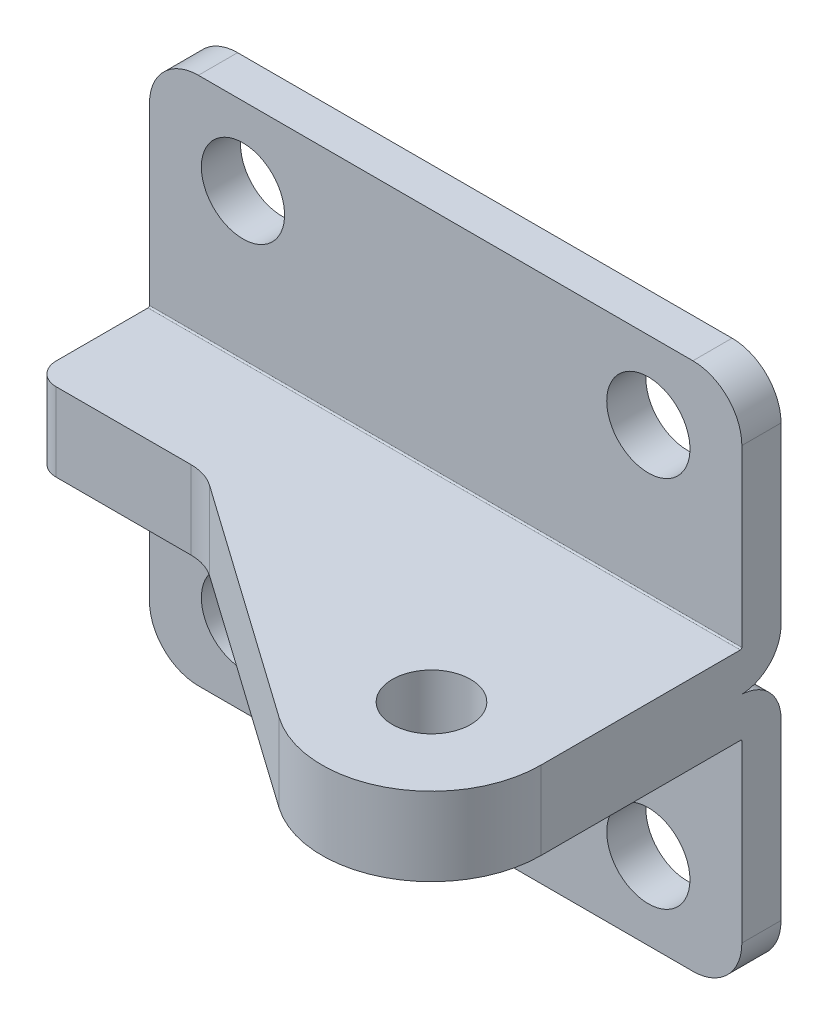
ISO-10303-21;
HEADER;
FILE_DESCRIPTION(('STEP AP214'),'2;1');
FILE_NAME('part.step','',(''),(''),'','','');
FILE_SCHEMA(('AUTOMOTIVE_DESIGN { 1 0 10303 214 1 1 1 1 }'));
ENDSEC;
DATA;
#1=APPLICATION_CONTEXT('core data for automotive mechanical design processes');
#2=APPLICATION_PROTOCOL_DEFINITION('international standard','automotive_design',2000,#1);
#3=PRODUCT_CONTEXT('',#1,'mechanical');
#4=PRODUCT('Part','Part','',(#3));
#5=PRODUCT_RELATED_PRODUCT_CATEGORY('part','',(#4));
#6=PRODUCT_DEFINITION_FORMATION('','',#4);
#7=PRODUCT_DEFINITION_CONTEXT('part definition',#1,'design');
#8=PRODUCT_DEFINITION('design','',#6,#7);
#9=PRODUCT_DEFINITION_SHAPE('','',#8);
#10=(LENGTH_UNIT() NAMED_UNIT(*) SI_UNIT(.MILLI.,.METRE.));
#11=(NAMED_UNIT(*) PLANE_ANGLE_UNIT() SI_UNIT($,.RADIAN.));
#12=(NAMED_UNIT(*) SI_UNIT($,.STERADIAN.) SOLID_ANGLE_UNIT());
#13=UNCERTAINTY_MEASURE_WITH_UNIT(LENGTH_MEASURE(1.E-05),#10,'distance_accuracy_value','');
#14=(GEOMETRIC_REPRESENTATION_CONTEXT(3) GLOBAL_UNCERTAINTY_ASSIGNED_CONTEXT((#13)) GLOBAL_UNIT_ASSIGNED_CONTEXT((#10,
#11,#12)) REPRESENTATION_CONTEXT('',''));
#15=CARTESIAN_POINT('',(0.,0.,0.));
#16=DIRECTION('',(0.,0.,1.));
#17=DIRECTION('',(1.,0.,0.));
#18=AXIS2_PLACEMENT_3D('',#15,#16,#17);
#19=CARTESIAN_POINT('',(-4.55,46.0499958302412,4.));
#20=DIRECTION('',(0.,-1.,0.));
#21=DIRECTION('',(1.,0.,0.));
#22=AXIS2_PLACEMENT_3D('',#19,#20,#21);
#23=PLANE('',#22);
#24=DIRECTION('',(0.,0.,-1.));
#25=VECTOR('',#24,1.);
#26=CARTESIAN_POINT('',(-4.55,46.0499958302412,4.));
#27=LINE('',#26,#25);
#28=CARTESIAN_POINT('',(-4.55,46.0499958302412,4.));
#29=VERTEX_POINT('',#28);
#30=CARTESIAN_POINT('',(-4.55,46.0499958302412,0.));
#31=VERTEX_POINT('',#30);
#32=EDGE_CURVE('E306',#29,#31,#27,.T.);
#33=ORIENTED_EDGE('',*,*,#32,.F.);
#34=DIRECTION('',(1.,0.,0.));
#35=VECTOR('',#34,1.);
#36=CARTESIAN_POINT('',(-4.55,46.0499958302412,4.));
#37=LINE('',#36,#35);
#38=CARTESIAN_POINT('',(45.95,46.0499958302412,4.));
#39=VERTEX_POINT('',#38);
#40=EDGE_CURVE('E307',#39,#29,#37,.F.);
#41=ORIENTED_EDGE('',*,*,#40,.F.);
#42=DIRECTION('',(0.,0.,1.));
#43=VECTOR('',#42,1.);
#44=CARTESIAN_POINT('',(45.95,46.0499958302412,4.));
#45=LINE('',#44,#43);
#46=CARTESIAN_POINT('',(45.95,46.0499958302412,0.));
#47=VERTEX_POINT('',#46);
#48=EDGE_CURVE('E303',#47,#39,#45,.T.);
#49=ORIENTED_EDGE('',*,*,#48,.F.);
#50=DIRECTION('',(-1.,0.,0.));
#51=VECTOR('',#50,1.);
#52=CARTESIAN_POINT('',(45.95,46.0499958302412,0.));
#53=LINE('',#52,#51);
#54=EDGE_CURVE('E323',#47,#31,#53,.T.);
#55=ORIENTED_EDGE('',*,*,#54,.T.);
#56=EDGE_LOOP('',(#33,#41,#49,#55));
#57=FACE_BOUND('',#56,.T.);
#58=ADVANCED_FACE('F14',(#57),#23,.F.);
#59=CARTESIAN_POINT('',(0.,38.0999958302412,4.));
#60=DIRECTION('',(0.,0.,1.));
#61=DIRECTION('',(-1.,0.,0.));
#62=AXIS2_PLACEMENT_3D('',#59,#60,#61);
#63=CYLINDRICAL_SURFACE('',#62,4.25);
#64=CARTESIAN_POINT('',(0.,38.0999958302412,0.));
#65=DIRECTION('',(0.,0.,1.));
#66=DIRECTION('',(-1.,0.,0.));
#67=AXIS2_PLACEMENT_3D('',#64,#65,#66);
#68=CIRCLE('',#67,4.25);
#69=CARTESIAN_POINT('',(-4.25,38.0999958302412,0.));
#70=VERTEX_POINT('',#69);
#71=EDGE_CURVE('E316',#70,#70,#68,.F.);
#72=ORIENTED_EDGE('',*,*,#71,.T.);
#73=EDGE_LOOP('',(#72));
#74=FACE_BOUND('',#73,.T.);
#75=CARTESIAN_POINT('',(0.,38.0999958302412,4.));
#76=DIRECTION('',(0.,0.,1.));
#77=DIRECTION('',(-1.,0.,0.));
#78=AXIS2_PLACEMENT_3D('',#75,#76,#77);
#79=CIRCLE('',#78,4.25);
#80=CARTESIAN_POINT('',(-4.25,38.0999958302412,4.));
#81=VERTEX_POINT('',#80);
#82=EDGE_CURVE('E298',#81,#81,#79,.F.);
#83=ORIENTED_EDGE('',*,*,#82,.F.);
#84=EDGE_LOOP('',(#83));
#85=FACE_BOUND('',#84,.T.);
#86=ADVANCED_FACE('F413',(#74,#85),#63,.F.);
#87=CARTESIAN_POINT('',(41.4,38.0999958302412,4.));
#88=DIRECTION('',(0.,0.,1.));
#89=DIRECTION('',(-1.,0.,0.));
#90=AXIS2_PLACEMENT_3D('',#87,#88,#89);
#91=CYLINDRICAL_SURFACE('',#90,4.25);
#92=CARTESIAN_POINT('',(41.4,38.0999958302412,0.));
#93=DIRECTION('',(0.,0.,1.));
#94=DIRECTION('',(-1.,0.,0.));
#95=AXIS2_PLACEMENT_3D('',#92,#93,#94);
#96=CIRCLE('',#95,4.25);
#97=CARTESIAN_POINT('',(37.15,38.0999958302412,0.));
#98=VERTEX_POINT('',#97);
#99=EDGE_CURVE('E313',#98,#98,#96,.F.);
#100=ORIENTED_EDGE('',*,*,#99,.T.);
#101=EDGE_LOOP('',(#100));
#102=FACE_BOUND('',#101,.T.);
#103=CARTESIAN_POINT('',(41.4,38.0999958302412,4.));
#104=DIRECTION('',(0.,0.,1.));
#105=DIRECTION('',(-1.,0.,0.));
#106=AXIS2_PLACEMENT_3D('',#103,#104,#105);
#107=CIRCLE('',#106,4.25);
#108=CARTESIAN_POINT('',(37.15,38.0999958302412,4.));
#109=VERTEX_POINT('',#108);
#110=EDGE_CURVE('E295',#109,#109,#107,.F.);
#111=ORIENTED_EDGE('',*,*,#110,.F.);
#112=EDGE_LOOP('',(#111));
#113=FACE_BOUND('',#112,.T.);
#114=ADVANCED_FACE('F419',(#102,#113),#91,.F.);
#115=CARTESIAN_POINT('',(-7.264,23.0499979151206,15.8097999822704));
#116=DIRECTION('',(0.,0.,-1.));
#117=DIRECTION('',(1.,0.,0.));
#118=AXIS2_PLACEMENT_3D('',#115,#116,#117);
#119=PLANE('',#118);
#120=DIRECTION('',(0.,-1.,0.));
#121=VECTOR('',#120,1.);
#122=CARTESIAN_POINT('',(6.49999999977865,23.0499979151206,15.8097999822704));
#123=LINE('',#122,#121);
#124=CARTESIAN_POINT('',(6.49999999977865,15.0499979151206,15.8097999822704));
#125=VERTEX_POINT('',#124);
#126=CARTESIAN_POINT('',(6.49999999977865,23.0499979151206,15.8097999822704));
#127=VERTEX_POINT('',#126);
#128=EDGE_CURVE('E278',#125,#127,#123,.F.);
#129=ORIENTED_EDGE('',*,*,#128,.T.);
#130=DIRECTION('',(1.,0.,0.));
#131=VECTOR('',#130,1.);
#132=CARTESIAN_POINT('',(-7.264,23.0499979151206,15.8097999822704));
#133=LINE('',#132,#131);
#134=CARTESIAN_POINT('',(-7.264,23.0499979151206,15.8097999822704));
#135=VERTEX_POINT('',#134);
#136=EDGE_CURVE('E272',#135,#127,#133,.T.);
#137=ORIENTED_EDGE('',*,*,#136,.F.);
#138=DIRECTION('',(0.,-1.,0.));
#139=VECTOR('',#138,1.);
#140=CARTESIAN_POINT('',(-7.264,23.0499979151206,15.8097999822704));
#141=LINE('',#140,#139);
#142=CARTESIAN_POINT('',(-7.264,15.0499979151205,15.8097999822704));
#143=VERTEX_POINT('',#142);
#144=EDGE_CURVE('E268',#143,#135,#141,.F.);
#145=ORIENTED_EDGE('',*,*,#144,.F.);
#146=DIRECTION('',(-1.,0.,0.));
#147=VECTOR('',#146,1.);
#148=CARTESIAN_POINT('',(45.95,15.0499979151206,15.8097999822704));
#149=LINE('',#148,#147);
#150=EDGE_CURVE('E213',#143,#125,#149,.F.);
#151=ORIENTED_EDGE('',*,*,#150,.T.);
#152=EDGE_LOOP('',(#129,#137,#145,#151));
#153=FACE_BOUND('',#152,.T.);
#154=ADVANCED_FACE('F428',(#153),#119,.F.);
#155=CARTESIAN_POINT('',(6.49999999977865,23.0499979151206,20.6357999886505));
#156=DIRECTION('',(0.,-1.,0.));
#157=DIRECTION('',(1.,0.,0.));
#158=AXIS2_PLACEMENT_3D('',#155,#156,#157);
#159=CYLINDRICAL_SURFACE('',#158,4.8260000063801);
#160=DIRECTION('',(0.,-1.,0.));
#161=VECTOR('',#160,1.);
#162=CARTESIAN_POINT('',(9.28151123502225,23.0499979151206,16.6920110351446));
#163=LINE('',#162,#161);
#164=CARTESIAN_POINT('',(9.28151123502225,15.0499979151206,16.6920110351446));
#165=VERTEX_POINT('',#164);
#166=CARTESIAN_POINT('',(9.28151123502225,23.0499979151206,16.6920110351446));
#167=VERTEX_POINT('',#166);
#168=EDGE_CURVE('E277',#165,#167,#163,.F.);
#169=ORIENTED_EDGE('',*,*,#168,.T.);
#170=CARTESIAN_POINT('',(6.49999999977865,23.0499979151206,20.6357999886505));
#171=DIRECTION('',(0.,-1.,0.));
#172=DIRECTION('',(1.,0.,0.));
#173=AXIS2_PLACEMENT_3D('',#170,#171,#172);
#174=CIRCLE('',#173,4.8260000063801);
#175=EDGE_CURVE('E275',#127,#167,#174,.T.);
#176=ORIENTED_EDGE('',*,*,#175,.F.);
#177=ORIENTED_EDGE('',*,*,#128,.F.);
#178=CARTESIAN_POINT('',(6.49999999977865,15.0499979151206,20.6357999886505));
#179=DIRECTION('',(0.,-1.,0.));
#180=DIRECTION('',(1.,0.,0.));
#181=AXIS2_PLACEMENT_3D('',#178,#179,#180);
#182=CIRCLE('',#181,4.8260000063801);
#183=EDGE_CURVE('E212',#125,#165,#182,.T.);
#184=ORIENTED_EDGE('',*,*,#183,.T.);
#185=EDGE_LOOP('',(#169,#176,#177,#184));
#186=FACE_BOUND('',#185,.T.);
#187=ADVANCED_FACE('F445',(#186),#159,.F.);
#188=CARTESIAN_POINT('',(9.28151123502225,23.0499979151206,16.6920110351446));
#189=DIRECTION('',(0.576359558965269,0.,-0.817196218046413));
#190=DIRECTION('',(0.817196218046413,0.,0.576359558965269));
#191=AXIS2_PLACEMENT_3D('',#188,#189,#190);
#192=PLANE('',#191);
#193=DIRECTION('',(0.,-1.,0.));
#194=VECTOR('',#193,1.);
#195=CARTESIAN_POINT('',(33.3326055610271,23.0499979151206,33.6549849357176));
#196=LINE('',#195,#194);
#197=CARTESIAN_POINT('',(33.3326055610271,23.0499979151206,33.6549849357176));
#198=VERTEX_POINT('',#197);
#199=CARTESIAN_POINT('',(33.3326055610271,15.0499979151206,33.6549849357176));
#200=VERTEX_POINT('',#199);
#201=EDGE_CURVE('E281',#198,#200,#196,.T.);
#202=ORIENTED_EDGE('',*,*,#201,.F.);
#203=DIRECTION('',(0.817196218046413,0.,0.576359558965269));
#204=VECTOR('',#203,1.);
#205=CARTESIAN_POINT('',(9.28151123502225,23.0499979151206,16.6920110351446));
#206=LINE('',#205,#204);
#207=EDGE_CURVE('E282',#167,#198,#206,.T.);
#208=ORIENTED_EDGE('',*,*,#207,.F.);
#209=ORIENTED_EDGE('',*,*,#168,.F.);
#210=DIRECTION('',(0.817196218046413,0.,0.576359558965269));
#211=VECTOR('',#210,1.);
#212=CARTESIAN_POINT('',(9.28151123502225,15.0499979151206,16.6920110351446));
#213=LINE('',#212,#211);
#214=EDGE_CURVE('E209',#165,#200,#213,.T.);
#215=ORIENTED_EDGE('',*,*,#214,.T.);
#216=EDGE_LOOP('',(#202,#208,#209,#215));
#217=FACE_BOUND('',#216,.T.);
#218=ADVANCED_FACE('F442',(#217),#192,.F.);
#219=CARTESIAN_POINT('',(-4.55,41.0499958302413,4.));
#220=DIRECTION('',(0.,0.,-1.));
#221=DIRECTION('',(1.,0.,0.));
#222=AXIS2_PLACEMENT_3D('',#219,#220,#221);
#223=CYLINDRICAL_SURFACE('',#222,5.);
#224=CARTESIAN_POINT('',(-4.55,41.0499958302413,4.));
#225=DIRECTION('',(0.,0.,-1.));
#226=DIRECTION('',(1.,0.,0.));
#227=AXIS2_PLACEMENT_3D('',#224,#225,#226);
#228=CIRCLE('',#227,5.);
#229=CARTESIAN_POINT('',(-9.55,41.0499958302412,4.));
#230=VERTEX_POINT('',#229);
#231=EDGE_CURVE('E304',#230,#29,#228,.T.);
#232=ORIENTED_EDGE('',*,*,#231,.T.);
#233=ORIENTED_EDGE('',*,*,#32,.T.);
#234=CARTESIAN_POINT('',(-4.55,41.0499958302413,0.));
#235=DIRECTION('',(0.,0.,-1.));
#236=DIRECTION('',(1.,0.,0.));
#237=AXIS2_PLACEMENT_3D('',#234,#235,#236);
#238=CIRCLE('',#237,5.);
#239=CARTESIAN_POINT('',(-9.55,41.0499958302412,0.));
#240=VERTEX_POINT('',#239);
#241=EDGE_CURVE('E324',#31,#240,#238,.F.);
#242=ORIENTED_EDGE('',*,*,#241,.T.);
#243=DIRECTION('',(0.,0.,1.));
#244=VECTOR('',#243,1.);
#245=CARTESIAN_POINT('',(-9.55,41.0499958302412,4.));
#246=LINE('',#245,#244);
#247=EDGE_CURVE('E352',#240,#230,#246,.T.);
#248=ORIENTED_EDGE('',*,*,#247,.T.);
#249=EDGE_LOOP('',(#232,#233,#242,#248));
#250=FACE_BOUND('',#249,.T.);
#251=ADVANCED_FACE('F382',(#250),#223,.T.);
#252=CARTESIAN_POINT('',(-7.264,23.0499979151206,13.5237999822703));
#253=DIRECTION('',(0.,-1.,0.));
#254=DIRECTION('',(1.,0.,0.));
#255=AXIS2_PLACEMENT_3D('',#252,#253,#254);
#256=CYLINDRICAL_SURFACE('',#255,2.286);
#257=CARTESIAN_POINT('',(-7.264,23.0499979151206,13.5237999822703));
#258=DIRECTION('',(0.,-1.,0.));
#259=DIRECTION('',(1.,0.,0.));
#260=AXIS2_PLACEMENT_3D('',#257,#258,#259);
#261=CIRCLE('',#260,2.286);
#262=CARTESIAN_POINT('',(-9.55,23.0499979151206,13.5237999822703));
#263=VERTEX_POINT('',#262);
#264=EDGE_CURVE('E267',#135,#263,#261,.T.);
#265=ORIENTED_EDGE('',*,*,#264,.T.);
#266=DIRECTION('',(0.,-1.,0.));
#267=VECTOR('',#266,1.);
#268=CARTESIAN_POINT('',(-9.55,23.0499979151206,13.5237999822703));
#269=LINE('',#268,#267);
#270=CARTESIAN_POINT('',(-9.55,15.0499979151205,13.5237999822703));
#271=VERTEX_POINT('',#270);
#272=EDGE_CURVE('E331',#263,#271,#269,.T.);
#273=ORIENTED_EDGE('',*,*,#272,.T.);
#274=CARTESIAN_POINT('',(-7.264,15.0499979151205,13.5237999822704));
#275=DIRECTION('',(0.,-1.,0.));
#276=DIRECTION('',(1.,0.,0.));
#277=AXIS2_PLACEMENT_3D('',#274,#275,#276);
#278=CIRCLE('',#277,2.286);
#279=EDGE_CURVE('E216',#271,#143,#278,.F.);
#280=ORIENTED_EDGE('',*,*,#279,.T.);
#281=ORIENTED_EDGE('',*,*,#144,.T.);
#282=EDGE_LOOP('',(#265,#273,#280,#281));
#283=FACE_BOUND('',#282,.T.);
#284=ADVANCED_FACE('F453',(#283),#256,.T.);
#285=CARTESIAN_POINT('',(-9.55,41.0499958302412,4.));
#286=DIRECTION('',(1.,0.,0.));
#287=DIRECTION('',(0.,0.,1.));
#288=AXIS2_PLACEMENT_3D('',#285,#286,#287);
#289=PLANE('',#288);
#290=DIRECTION('',(0.,-1.,0.));
#291=VECTOR('',#290,1.);
#292=CARTESIAN_POINT('',(-9.55,41.0499958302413,0.));
#293=LINE('',#292,#291);
#294=CARTESIAN_POINT('',(-9.55,23.1999979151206,0.));
#295=VERTEX_POINT('',#294);
#296=EDGE_CURVE('E327',#240,#295,#293,.T.);
#297=ORIENTED_EDGE('',*,*,#296,.T.);
#298=CARTESIAN_POINT('',(-9.55,23.1999979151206,4.15));
#299=DIRECTION('',(-1.,0.,0.));
#300=DIRECTION('',(0.,0.,-1.));
#301=AXIS2_PLACEMENT_3D('',#298,#299,#300);
#302=CIRCLE('',#301,4.15);
#303=CARTESIAN_POINT('',(-9.55,19.0499979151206,4.15));
#304=VERTEX_POINT('',#303);
#305=EDGE_CURVE('E249',#304,#295,#302,.F.);
#306=ORIENTED_EDGE('',*,*,#305,.F.);
#307=CARTESIAN_POINT('',(-9.55,14.8999979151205,4.15));
#308=DIRECTION('',(-1.,0.,0.));
#309=DIRECTION('',(0.,0.,-1.));
#310=AXIS2_PLACEMENT_3D('',#307,#308,#309);
#311=CIRCLE('',#310,4.15);
#312=CARTESIAN_POINT('',(-9.55,14.8999979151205,0.));
#313=VERTEX_POINT('',#312);
#314=EDGE_CURVE('E155',#304,#313,#311,.T.);
#315=ORIENTED_EDGE('',*,*,#314,.T.);
#316=DIRECTION('',(0.,-1.,0.));
#317=VECTOR('',#316,1.);
#318=CARTESIAN_POINT('',(-9.55,-2.95,0.));
#319=LINE('',#318,#317);
#320=CARTESIAN_POINT('',(-9.55,-2.95,0.));
#321=VERTEX_POINT('',#320);
#322=EDGE_CURVE('E188',#321,#313,#319,.F.);
#323=ORIENTED_EDGE('',*,*,#322,.F.);
#324=DIRECTION('',(0.,0.,1.));
#325=VECTOR('',#324,1.);
#326=CARTESIAN_POINT('',(-9.55,-2.95,0.));
#327=LINE('',#326,#325);
#328=CARTESIAN_POINT('',(-9.55,-2.95,4.));
#329=VERTEX_POINT('',#328);
#330=EDGE_CURVE('E171',#329,#321,#327,.F.);
#331=ORIENTED_EDGE('',*,*,#330,.F.);
#332=DIRECTION('',(0.,-1.,0.));
#333=VECTOR('',#332,1.);
#334=CARTESIAN_POINT('',(-9.55,-2.9500000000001,4.));
#335=LINE('',#334,#333);
#336=CARTESIAN_POINT('',(-9.55,14.8999979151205,4.));
#337=VERTEX_POINT('',#336);
#338=EDGE_CURVE('E162',#329,#337,#335,.F.);
#339=ORIENTED_EDGE('',*,*,#338,.T.);
#340=CARTESIAN_POINT('',(-9.55,14.8999979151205,4.15));
#341=DIRECTION('',(-1.,0.,0.));
#342=DIRECTION('',(0.,0.,-1.));
#343=AXIS2_PLACEMENT_3D('',#340,#341,#342);
#344=CIRCLE('',#343,0.15);
#345=CARTESIAN_POINT('',(-9.55,15.0499979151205,4.15));
#346=VERTEX_POINT('',#345);
#347=EDGE_CURVE('E18',#337,#346,#344,.F.);
#348=ORIENTED_EDGE('',*,*,#347,.T.);
#349=DIRECTION('',(0.,0.,1.));
#350=VECTOR('',#349,1.);
#351=CARTESIAN_POINT('',(-9.55,15.0499979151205,-17.0772100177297));
#352=LINE('',#351,#350);
#353=EDGE_CURVE('E217',#346,#271,#352,.T.);
#354=ORIENTED_EDGE('',*,*,#353,.T.);
#355=ORIENTED_EDGE('',*,*,#272,.F.);
#356=DIRECTION('',(0.,0.,1.));
#357=VECTOR('',#356,1.);
#358=CARTESIAN_POINT('',(-9.55,23.0499979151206,-17.0772100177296));
#359=LINE('',#358,#357);
#360=CARTESIAN_POINT('',(-9.55,23.0499979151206,4.15));
#361=VERTEX_POINT('',#360);
#362=EDGE_CURVE('E286',#361,#263,#359,.T.);
#363=ORIENTED_EDGE('',*,*,#362,.F.);
#364=CARTESIAN_POINT('',(-9.55,23.1999979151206,4.15));
#365=DIRECTION('',(-1.,0.,0.));
#366=DIRECTION('',(0.,0.,-1.));
#367=AXIS2_PLACEMENT_3D('',#364,#365,#366);
#368=CIRCLE('',#367,0.15);
#369=CARTESIAN_POINT('',(-9.55,23.1999979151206,4.));
#370=VERTEX_POINT('',#369);
#371=EDGE_CURVE('E287',#370,#361,#368,.T.);
#372=ORIENTED_EDGE('',*,*,#371,.F.);
#373=DIRECTION('',(0.,-1.,0.));
#374=VECTOR('',#373,1.);
#375=CARTESIAN_POINT('',(-9.55,41.0499958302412,4.));
#376=LINE('',#375,#374);
#377=EDGE_CURVE('E310',#230,#370,#376,.T.);
#378=ORIENTED_EDGE('',*,*,#377,.F.);
#379=ORIENTED_EDGE('',*,*,#247,.F.);
#380=EDGE_LOOP('',(#297,#306,#315,#323,#331,#339,#348,#354,#355,#363,#372,#378,#379));
#381=FACE_BOUND('',#380,.T.);
#382=ADVANCED_FACE('F168',(#381),#289,.F.);
#383=CARTESIAN_POINT('',(45.95,41.0499958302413,4.));
#384=DIRECTION('',(0.,0.,-1.));
#385=DIRECTION('',(1.,0.,0.));
#386=AXIS2_PLACEMENT_3D('',#383,#384,#385);
#387=CYLINDRICAL_SURFACE('',#386,5.);
#388=CARTESIAN_POINT('',(45.95,41.0499958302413,4.));
#389=DIRECTION('',(0.,0.,-1.));
#390=DIRECTION('',(1.,0.,0.));
#391=AXIS2_PLACEMENT_3D('',#388,#389,#390);
#392=CIRCLE('',#391,5.);
#393=CARTESIAN_POINT('',(50.95,41.0499958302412,4.));
#394=VERTEX_POINT('',#393);
#395=EDGE_CURVE('E301',#39,#394,#392,.T.);
#396=ORIENTED_EDGE('',*,*,#395,.T.);
#397=DIRECTION('',(0.,0.,-1.));
#398=VECTOR('',#397,1.);
#399=CARTESIAN_POINT('',(50.95,41.0499958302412,4.));
#400=LINE('',#399,#398);
#401=CARTESIAN_POINT('',(50.95,41.0499958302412,0.));
#402=VERTEX_POINT('',#401);
#403=EDGE_CURVE('E312',#394,#402,#400,.T.);
#404=ORIENTED_EDGE('',*,*,#403,.T.);
#405=CARTESIAN_POINT('',(45.95,41.0499958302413,0.));
#406=DIRECTION('',(0.,0.,-1.));
#407=DIRECTION('',(1.,0.,0.));
#408=AXIS2_PLACEMENT_3D('',#405,#406,#407);
#409=CIRCLE('',#408,5.);
#410=EDGE_CURVE('E320',#402,#47,#409,.F.);
#411=ORIENTED_EDGE('',*,*,#410,.T.);
#412=ORIENTED_EDGE('',*,*,#48,.T.);
#413=EDGE_LOOP('',(#396,#404,#411,#412));
#414=FACE_BOUND('',#413,.T.);
#415=ADVANCED_FACE('F392',(#414),#387,.T.);
#416=CARTESIAN_POINT('',(45.95,41.0499958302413,0.));
#417=DIRECTION('',(0.,0.,1.));
#418=DIRECTION('',(-1.,0.,0.));
#419=AXIS2_PLACEMENT_3D('',#416,#417,#418);
#420=PLANE('',#419);
#421=DIRECTION('',(-1.,0.,0.));
#422=VECTOR('',#421,1.);
#423=CARTESIAN_POINT('',(45.95,23.1999979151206,0.));
#424=LINE('',#423,#422);
#425=CARTESIAN_POINT('',(50.95,23.1999979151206,0.));
#426=VERTEX_POINT('',#425);
#427=EDGE_CURVE('E24',#295,#426,#424,.F.);
#428=ORIENTED_EDGE('',*,*,#427,.F.);
#429=ORIENTED_EDGE('',*,*,#296,.F.);
#430=ORIENTED_EDGE('',*,*,#241,.F.);
#431=ORIENTED_EDGE('',*,*,#54,.F.);
#432=ORIENTED_EDGE('',*,*,#410,.F.);
#433=DIRECTION('',(0.,-1.,0.));
#434=VECTOR('',#433,1.);
#435=CARTESIAN_POINT('',(50.95,41.0499958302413,0.));
#436=LINE('',#435,#434);
#437=EDGE_CURVE('E9',#426,#402,#436,.F.);
#438=ORIENTED_EDGE('',*,*,#437,.F.);
#439=EDGE_LOOP('',(#428,#429,#430,#431,#432,#438));
#440=FACE_BOUND('',#439,.T.);
#441=ORIENTED_EDGE('',*,*,#71,.F.);
#442=EDGE_LOOP('',(#441));
#443=FACE_BOUND('',#442,.T.);
#444=ORIENTED_EDGE('',*,*,#99,.F.);
#445=EDGE_LOOP('',(#444));
#446=FACE_BOUND('',#445,.T.);
#447=ADVANCED_FACE('F376',(#440,#443,#446),#420,.F.);
#448=CARTESIAN_POINT('',(81.426069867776,23.1999979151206,4.15));
#449=DIRECTION('',(-1.,0.,0.));
#450=DIRECTION('',(0.,0.,-1.));
#451=AXIS2_PLACEMENT_3D('',#448,#449,#450);
#452=CYLINDRICAL_SURFACE('',#451,4.15);
#453=DIRECTION('',(-1.,0.,0.));
#454=VECTOR('',#453,1.);
#455=CARTESIAN_POINT('',(81.426069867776,19.0499979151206,4.15));
#456=LINE('',#455,#454);
#457=CARTESIAN_POINT('',(50.95,19.0499979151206,4.15));
#458=VERTEX_POINT('',#457);
#459=EDGE_CURVE('E309',#458,#304,#456,.T.);
#460=ORIENTED_EDGE('',*,*,#459,.T.);
#461=ORIENTED_EDGE('',*,*,#305,.T.);
#462=ORIENTED_EDGE('',*,*,#427,.T.);
#463=CARTESIAN_POINT('',(50.95,23.1999979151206,4.15));
#464=DIRECTION('',(-1.,0.,0.));
#465=DIRECTION('',(0.,0.,-1.));
#466=AXIS2_PLACEMENT_3D('',#463,#464,#465);
#467=CIRCLE('',#466,4.15);
#468=EDGE_CURVE('E32',#426,#458,#467,.T.);
#469=ORIENTED_EDGE('',*,*,#468,.T.);
#470=EDGE_LOOP('',(#460,#461,#462,#469));
#471=FACE_BOUND('',#470,.T.);
#472=ADVANCED_FACE('F396',(#471),#452,.T.);
#473=CARTESIAN_POINT('',(39.7739999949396,23.0499979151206,24.5219999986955));
#474=DIRECTION('',(0.,-1.,0.));
#475=DIRECTION('',(1.,0.,0.));
#476=AXIS2_PLACEMENT_3D('',#473,#474,#475);
#477=CYLINDRICAL_SURFACE('',#476,11.1760000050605);
#478=CARTESIAN_POINT('',(39.7739999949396,23.0499979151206,24.5219999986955));
#479=DIRECTION('',(0.,-1.,0.));
#480=DIRECTION('',(1.,0.,0.));
#481=AXIS2_PLACEMENT_3D('',#478,#479,#480);
#482=CIRCLE('',#481,11.1760000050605);
#483=CARTESIAN_POINT('',(50.95,23.0499979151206,24.5219999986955));
#484=VERTEX_POINT('',#483);
#485=EDGE_CURVE('E279',#484,#198,#482,.T.);
#486=ORIENTED_EDGE('',*,*,#485,.T.);
#487=ORIENTED_EDGE('',*,*,#201,.T.);
#488=CARTESIAN_POINT('',(39.7739999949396,15.0499979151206,24.5219999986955));
#489=DIRECTION('',(0.,-1.,0.));
#490=DIRECTION('',(1.,0.,0.));
#491=AXIS2_PLACEMENT_3D('',#488,#489,#490);
#492=CIRCLE('',#491,11.1760000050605);
#493=CARTESIAN_POINT('',(50.95,15.0499979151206,24.5219999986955));
#494=VERTEX_POINT('',#493);
#495=EDGE_CURVE('E208',#200,#494,#492,.F.);
#496=ORIENTED_EDGE('',*,*,#495,.T.);
#497=DIRECTION('',(0.,-1.,0.));
#498=VECTOR('',#497,1.);
#499=CARTESIAN_POINT('',(50.95,23.0499979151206,24.5219999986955));
#500=LINE('',#499,#498);
#501=EDGE_CURVE('E332',#494,#484,#500,.F.);
#502=ORIENTED_EDGE('',*,*,#501,.T.);
#503=EDGE_LOOP('',(#486,#487,#496,#502));
#504=FACE_BOUND('',#503,.T.);
#505=ADVANCED_FACE('F398',(#504),#477,.T.);
#506=CARTESIAN_POINT('',(45.95,23.0499979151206,-17.0772100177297));
#507=DIRECTION('',(0.,1.,0.));
#508=DIRECTION('',(-1.,0.,0.));
#509=AXIS2_PLACEMENT_3D('',#506,#507,#508);
#510=PLANE('',#509);
#511=ORIENTED_EDGE('',*,*,#207,.T.);
#512=ORIENTED_EDGE('',*,*,#485,.F.);
#513=DIRECTION('',(0.,0.,-1.));
#514=VECTOR('',#513,1.);
#515=CARTESIAN_POINT('',(50.95,23.0499979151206,24.5219999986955));
#516=LINE('',#515,#514);
#517=CARTESIAN_POINT('',(50.95,23.0499979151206,4.15));
#518=VERTEX_POINT('',#517);
#519=EDGE_CURVE('E341',#484,#518,#516,.T.);
#520=ORIENTED_EDGE('',*,*,#519,.T.);
#521=DIRECTION('',(-1.,0.,0.));
#522=VECTOR('',#521,1.);
#523=CARTESIAN_POINT('',(81.426069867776,23.0499979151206,4.15));
#524=LINE('',#523,#522);
#525=EDGE_CURVE('E291',#518,#361,#524,.T.);
#526=ORIENTED_EDGE('',*,*,#525,.T.);
#527=ORIENTED_EDGE('',*,*,#362,.T.);
#528=ORIENTED_EDGE('',*,*,#264,.F.);
#529=ORIENTED_EDGE('',*,*,#136,.T.);
#530=ORIENTED_EDGE('',*,*,#175,.T.);
#531=EDGE_LOOP('',(#511,#512,#520,#526,#527,#528,#529,#530));
#532=FACE_BOUND('',#531,.T.);
#533=CARTESIAN_POINT('',(39.7739999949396,23.0499979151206,24.5219999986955));
#534=DIRECTION('',(0.,-1.,0.));
#535=DIRECTION('',(1.,0.,0.));
#536=AXIS2_PLACEMENT_3D('',#533,#534,#535);
#537=CIRCLE('',#536,4.);
#538=CARTESIAN_POINT('',(43.7739999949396,23.0499979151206,24.5219999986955));
#539=VERTEX_POINT('',#538);
#540=EDGE_CURVE('E283',#539,#539,#537,.T.);
#541=ORIENTED_EDGE('',*,*,#540,.T.);
#542=EDGE_LOOP('',(#541));
#543=FACE_BOUND('',#542,.T.);
#544=ADVANCED_FACE('F406',(#532,#543),#510,.T.);
#545=CARTESIAN_POINT('',(81.426069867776,23.1999979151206,4.15));
#546=DIRECTION('',(-1.,0.,0.));
#547=DIRECTION('',(0.,0.,-1.));
#548=AXIS2_PLACEMENT_3D('',#545,#546,#547);
#549=CYLINDRICAL_SURFACE('',#548,0.15);
#550=ORIENTED_EDGE('',*,*,#371,.T.);
#551=ORIENTED_EDGE('',*,*,#525,.F.);
#552=CARTESIAN_POINT('',(50.95,23.1999979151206,4.15));
#553=DIRECTION('',(-1.,0.,0.));
#554=DIRECTION('',(0.,0.,-1.));
#555=AXIS2_PLACEMENT_3D('',#552,#553,#554);
#556=CIRCLE('',#555,0.15);
#557=CARTESIAN_POINT('',(50.95,23.1999979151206,4.));
#558=VERTEX_POINT('',#557);
#559=EDGE_CURVE('E290',#518,#558,#556,.F.);
#560=ORIENTED_EDGE('',*,*,#559,.T.);
#561=DIRECTION('',(-1.,0.,0.));
#562=VECTOR('',#561,1.);
#563=CARTESIAN_POINT('',(45.95,23.1999979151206,4.));
#564=LINE('',#563,#562);
#565=EDGE_CURVE('E294',#370,#558,#564,.F.);
#566=ORIENTED_EDGE('',*,*,#565,.F.);
#567=EDGE_LOOP('',(#550,#551,#560,#566));
#568=FACE_BOUND('',#567,.T.);
#569=ADVANCED_FACE('F433',(#568),#549,.F.);
#570=CARTESIAN_POINT('',(45.95,41.0499958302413,4.));
#571=DIRECTION('',(0.,0.,1.));
#572=DIRECTION('',(-1.,0.,0.));
#573=AXIS2_PLACEMENT_3D('',#570,#571,#572);
#574=PLANE('',#573);
#575=ORIENTED_EDGE('',*,*,#110,.T.);
#576=EDGE_LOOP('',(#575));
#577=FACE_BOUND('',#576,.T.);
#578=ORIENTED_EDGE('',*,*,#82,.T.);
#579=EDGE_LOOP('',(#578));
#580=FACE_BOUND('',#579,.T.);
#581=ORIENTED_EDGE('',*,*,#231,.F.);
#582=ORIENTED_EDGE('',*,*,#377,.T.);
#583=ORIENTED_EDGE('',*,*,#565,.T.);
#584=DIRECTION('',(0.,-1.,0.));
#585=VECTOR('',#584,1.);
#586=CARTESIAN_POINT('',(50.95,-0.549214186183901,4.));
#587=LINE('',#586,#585);
#588=EDGE_CURVE('E317',#558,#394,#587,.F.);
#589=ORIENTED_EDGE('',*,*,#588,.T.);
#590=ORIENTED_EDGE('',*,*,#395,.F.);
#591=ORIENTED_EDGE('',*,*,#40,.T.);
#592=EDGE_LOOP('',(#581,#582,#583,#589,#590,#591));
#593=FACE_BOUND('',#592,.T.);
#594=ADVANCED_FACE('F430',(#577,#580,#593),#574,.T.);
#595=CARTESIAN_POINT('',(50.95,-0.549214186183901,4.));
#596=DIRECTION('',(-1.,0.,0.));
#597=DIRECTION('',(0.,0.,-1.));
#598=AXIS2_PLACEMENT_3D('',#595,#596,#597);
#599=PLANE('',#598);
#600=ORIENTED_EDGE('',*,*,#588,.F.);
#601=ORIENTED_EDGE('',*,*,#559,.F.);
#602=ORIENTED_EDGE('',*,*,#519,.F.);
#603=ORIENTED_EDGE('',*,*,#501,.F.);
#604=DIRECTION('',(0.,0.,1.));
#605=VECTOR('',#604,1.);
#606=CARTESIAN_POINT('',(50.95,15.0499979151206,-17.0772100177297));
#607=LINE('',#606,#605);
#608=CARTESIAN_POINT('',(50.95,15.0499979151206,4.15));
#609=VERTEX_POINT('',#608);
#610=EDGE_CURVE('E205',#494,#609,#607,.F.);
#611=ORIENTED_EDGE('',*,*,#610,.T.);
#612=CARTESIAN_POINT('',(50.95,14.8999979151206,4.15));
#613=DIRECTION('',(-1.,0.,0.));
#614=DIRECTION('',(0.,0.,-1.));
#615=AXIS2_PLACEMENT_3D('',#612,#613,#614);
#616=CIRCLE('',#615,0.15);
#617=CARTESIAN_POINT('',(50.95,14.8999979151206,4.));
#618=VERTEX_POINT('',#617);
#619=EDGE_CURVE('E185',#609,#618,#616,.T.);
#620=ORIENTED_EDGE('',*,*,#619,.T.);
#621=DIRECTION('',(0.,-1.,0.));
#622=VECTOR('',#621,1.);
#623=CARTESIAN_POINT('',(50.95,-2.95,4.));
#624=LINE('',#623,#622);
#625=CARTESIAN_POINT('',(50.95,-2.95,4.));
#626=VERTEX_POINT('',#625);
#627=EDGE_CURVE('E165',#618,#626,#624,.T.);
#628=ORIENTED_EDGE('',*,*,#627,.T.);
#629=DIRECTION('',(0.,0.,-1.));
#630=VECTOR('',#629,1.);
#631=CARTESIAN_POINT('',(50.95,-2.95,0.));
#632=LINE('',#631,#630);
#633=CARTESIAN_POINT('',(50.95,-2.95,0.));
#634=VERTEX_POINT('',#633);
#635=EDGE_CURVE('E182',#634,#626,#632,.F.);
#636=ORIENTED_EDGE('',*,*,#635,.F.);
#637=DIRECTION('',(0.,-1.,0.));
#638=VECTOR('',#637,1.);
#639=CARTESIAN_POINT('',(50.95,38.6492100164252,0.));
#640=LINE('',#639,#638);
#641=CARTESIAN_POINT('',(50.95,14.8999979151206,0.));
#642=VERTEX_POINT('',#641);
#643=EDGE_CURVE('E184',#642,#634,#640,.T.);
#644=ORIENTED_EDGE('',*,*,#643,.F.);
#645=CARTESIAN_POINT('',(50.95,14.8999979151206,4.15));
#646=DIRECTION('',(-1.,0.,0.));
#647=DIRECTION('',(0.,0.,-1.));
#648=AXIS2_PLACEMENT_3D('',#645,#646,#647);
#649=CIRCLE('',#648,4.15);
#650=EDGE_CURVE('E203',#642,#458,#649,.F.);
#651=ORIENTED_EDGE('',*,*,#650,.T.);
#652=ORIENTED_EDGE('',*,*,#468,.F.);
#653=ORIENTED_EDGE('',*,*,#437,.T.);
#654=ORIENTED_EDGE('',*,*,#403,.F.);
#655=EDGE_LOOP('',(#600,#601,#602,#603,#611,#620,#628,#636,#644,#651,#652,#653,#654));
#656=FACE_BOUND('',#655,.T.);
#657=ADVANCED_FACE('F266',(#656),#599,.F.);
#658=CARTESIAN_POINT('',(39.7739999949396,19.0499979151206,24.5219999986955));
#659=DIRECTION('',(0.,-1.,0.));
#660=DIRECTION('',(1.,0.,0.));
#661=AXIS2_PLACEMENT_3D('',#658,#659,#660);
#662=CYLINDRICAL_SURFACE('',#661,4.);
#663=ORIENTED_EDGE('',*,*,#540,.F.);
#664=EDGE_LOOP('',(#663));
#665=FACE_BOUND('',#664,.T.);
#666=CARTESIAN_POINT('',(39.7739999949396,15.0499979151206,24.5219999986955));
#667=DIRECTION('',(0.,-1.,0.));
#668=DIRECTION('',(1.,0.,0.));
#669=AXIS2_PLACEMENT_3D('',#666,#667,#668);
#670=CIRCLE('',#669,4.);
#671=CARTESIAN_POINT('',(43.7739999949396,15.0499979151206,24.5219999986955));
#672=VERTEX_POINT('',#671);
#673=EDGE_CURVE('E207',#672,#672,#670,.T.);
#674=ORIENTED_EDGE('',*,*,#673,.T.);
#675=EDGE_LOOP('',(#674));
#676=FACE_BOUND('',#675,.T.);
#677=ADVANCED_FACE('F438',(#665,#676),#662,.F.);
#678=CARTESIAN_POINT('',(-4.55,-7.95,0.));
#679=DIRECTION('',(0.,1.,0.));
#680=DIRECTION('',(-1.,0.,0.));
#681=AXIS2_PLACEMENT_3D('',#678,#679,#680);
#682=PLANE('',#681);
#683=DIRECTION('',(0.,0.,1.));
#684=VECTOR('',#683,1.);
#685=CARTESIAN_POINT('',(-4.55,-7.95,0.));
#686=LINE('',#685,#684);
#687=CARTESIAN_POINT('',(-4.55,-7.95,0.));
#688=VERTEX_POINT('',#687);
#689=CARTESIAN_POINT('',(-4.55,-7.95,4.));
#690=VERTEX_POINT('',#689);
#691=EDGE_CURVE('E189',#688,#690,#686,.T.);
#692=ORIENTED_EDGE('',*,*,#691,.F.);
#693=DIRECTION('',(-1.,0.,0.));
#694=VECTOR('',#693,1.);
#695=CARTESIAN_POINT('',(-4.55,-7.95,0.));
#696=LINE('',#695,#694);
#697=CARTESIAN_POINT('',(45.95,-7.95,0.));
#698=VERTEX_POINT('',#697);
#699=EDGE_CURVE('E195',#698,#688,#696,.T.);
#700=ORIENTED_EDGE('',*,*,#699,.F.);
#701=DIRECTION('',(0.,0.,1.));
#702=VECTOR('',#701,1.);
#703=CARTESIAN_POINT('',(45.95,-7.95,0.));
#704=LINE('',#703,#702);
#705=CARTESIAN_POINT('',(45.95,-7.95,4.));
#706=VERTEX_POINT('',#705);
#707=EDGE_CURVE('E192',#706,#698,#704,.F.);
#708=ORIENTED_EDGE('',*,*,#707,.F.);
#709=DIRECTION('',(1.,0.,0.));
#710=VECTOR('',#709,1.);
#711=CARTESIAN_POINT('',(45.95,-7.95,4.));
#712=LINE('',#711,#710);
#713=EDGE_CURVE('E174',#706,#690,#712,.F.);
#714=ORIENTED_EDGE('',*,*,#713,.T.);
#715=EDGE_LOOP('',(#692,#700,#708,#714));
#716=FACE_BOUND('',#715,.T.);
#717=ADVANCED_FACE('F261',(#716),#682,.F.);
#718=CARTESIAN_POINT('',(0.,0.,0.));
#719=DIRECTION('',(0.,0.,-1.));
#720=DIRECTION('',(1.,0.,0.));
#721=AXIS2_PLACEMENT_3D('',#718,#719,#720);
#722=CYLINDRICAL_SURFACE('',#721,4.25);
#723=CARTESIAN_POINT('',(0.,0.,4.));
#724=DIRECTION('',(0.,0.,-1.));
#725=DIRECTION('',(1.,0.,0.));
#726=AXIS2_PLACEMENT_3D('',#723,#724,#725);
#727=CIRCLE('',#726,4.25);
#728=CARTESIAN_POINT('',(4.25,0.,4.));
#729=VERTEX_POINT('',#728);
#730=EDGE_CURVE('E225',#729,#729,#727,.F.);
#731=ORIENTED_EDGE('',*,*,#730,.T.);
#732=EDGE_LOOP('',(#731));
#733=FACE_BOUND('',#732,.T.);
#734=CARTESIAN_POINT('',(0.,0.,0.));
#735=DIRECTION('',(0.,0.,-1.));
#736=DIRECTION('',(1.,0.,0.));
#737=AXIS2_PLACEMENT_3D('',#734,#735,#736);
#738=CIRCLE('',#737,4.25);
#739=CARTESIAN_POINT('',(4.25,0.,0.));
#740=VERTEX_POINT('',#739);
#741=EDGE_CURVE('E233',#740,#740,#738,.F.);
#742=ORIENTED_EDGE('',*,*,#741,.F.);
#743=EDGE_LOOP('',(#742));
#744=FACE_BOUND('',#743,.T.);
#745=ADVANCED_FACE('F469',(#733,#744),#722,.F.);
#746=CARTESIAN_POINT('',(41.4,0.,0.));
#747=DIRECTION('',(0.,0.,-1.));
#748=DIRECTION('',(1.,0.,0.));
#749=AXIS2_PLACEMENT_3D('',#746,#747,#748);
#750=CYLINDRICAL_SURFACE('',#749,4.25);
#751=CARTESIAN_POINT('',(41.4,0.,4.));
#752=DIRECTION('',(0.,0.,-1.));
#753=DIRECTION('',(1.,0.,0.));
#754=AXIS2_PLACEMENT_3D('',#751,#752,#753);
#755=CIRCLE('',#754,4.25);
#756=CARTESIAN_POINT('',(45.65,0.,4.));
#757=VERTEX_POINT('',#756);
#758=EDGE_CURVE('E199',#757,#757,#755,.F.);
#759=ORIENTED_EDGE('',*,*,#758,.T.);
#760=EDGE_LOOP('',(#759));
#761=FACE_BOUND('',#760,.T.);
#762=CARTESIAN_POINT('',(41.4,0.,0.));
#763=DIRECTION('',(0.,0.,-1.));
#764=DIRECTION('',(1.,0.,0.));
#765=AXIS2_PLACEMENT_3D('',#762,#763,#764);
#766=CIRCLE('',#765,4.25);
#767=CARTESIAN_POINT('',(45.65,0.,0.));
#768=VERTEX_POINT('',#767);
#769=EDGE_CURVE('E202',#768,#768,#766,.F.);
#770=ORIENTED_EDGE('',*,*,#769,.F.);
#771=EDGE_LOOP('',(#770));
#772=FACE_BOUND('',#771,.T.);
#773=ADVANCED_FACE('F466',(#761,#772),#750,.F.);
#774=CARTESIAN_POINT('',(-4.55,-2.95,0.));
#775=DIRECTION('',(0.,0.,1.));
#776=DIRECTION('',(-1.,0.,0.));
#777=AXIS2_PLACEMENT_3D('',#774,#775,#776);
#778=CYLINDRICAL_SURFACE('',#777,5.);
#779=CARTESIAN_POINT('',(-4.55,-2.95,0.));
#780=DIRECTION('',(0.,0.,1.));
#781=DIRECTION('',(-1.,0.,0.));
#782=AXIS2_PLACEMENT_3D('',#779,#780,#781);
#783=CIRCLE('',#782,5.);
#784=EDGE_CURVE('E191',#321,#688,#783,.T.);
#785=ORIENTED_EDGE('',*,*,#784,.T.);
#786=ORIENTED_EDGE('',*,*,#691,.T.);
#787=CARTESIAN_POINT('',(-4.55,-2.95,4.));
#788=DIRECTION('',(0.,0.,1.));
#789=DIRECTION('',(-1.,0.,0.));
#790=AXIS2_PLACEMENT_3D('',#787,#788,#789);
#791=CIRCLE('',#790,5.);
#792=EDGE_CURVE('E172',#690,#329,#791,.F.);
#793=ORIENTED_EDGE('',*,*,#792,.T.);
#794=ORIENTED_EDGE('',*,*,#330,.T.);
#795=EDGE_LOOP('',(#785,#786,#793,#794));
#796=FACE_BOUND('',#795,.T.);
#797=ADVANCED_FACE('F258',(#796),#778,.T.);
#798=CARTESIAN_POINT('',(45.95,-2.95,0.));
#799=DIRECTION('',(0.,0.,1.));
#800=DIRECTION('',(-1.,0.,0.));
#801=AXIS2_PLACEMENT_3D('',#798,#799,#800);
#802=CYLINDRICAL_SURFACE('',#801,5.);
#803=CARTESIAN_POINT('',(45.95,-2.95,0.));
#804=DIRECTION('',(0.,0.,1.));
#805=DIRECTION('',(-1.,0.,0.));
#806=AXIS2_PLACEMENT_3D('',#803,#804,#805);
#807=CIRCLE('',#806,5.);
#808=EDGE_CURVE('E196',#698,#634,#807,.T.);
#809=ORIENTED_EDGE('',*,*,#808,.T.);
#810=ORIENTED_EDGE('',*,*,#635,.T.);
#811=CARTESIAN_POINT('',(45.95,-2.95,4.));
#812=DIRECTION('',(0.,0.,1.));
#813=DIRECTION('',(-1.,0.,0.));
#814=AXIS2_PLACEMENT_3D('',#811,#812,#813);
#815=CIRCLE('',#814,5.);
#816=EDGE_CURVE('E181',#626,#706,#815,.F.);
#817=ORIENTED_EDGE('',*,*,#816,.T.);
#818=ORIENTED_EDGE('',*,*,#707,.T.);
#819=EDGE_LOOP('',(#809,#810,#817,#818));
#820=FACE_BOUND('',#819,.T.);
#821=ADVANCED_FACE('F263',(#820),#802,.T.);
#822=CARTESIAN_POINT('',(45.95,-2.95,4.));
#823=DIRECTION('',(0.,0.,-1.));
#824=DIRECTION('',(1.,0.,0.));
#825=AXIS2_PLACEMENT_3D('',#822,#823,#824);
#826=PLANE('',#825);
#827=DIRECTION('',(1.,0.,0.));
#828=VECTOR('',#827,1.);
#829=CARTESIAN_POINT('',(45.95,14.8999979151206,4.));
#830=LINE('',#829,#828);
#831=EDGE_CURVE('E148',#337,#618,#830,.T.);
#832=ORIENTED_EDGE('',*,*,#831,.F.);
#833=ORIENTED_EDGE('',*,*,#338,.F.);
#834=ORIENTED_EDGE('',*,*,#792,.F.);
#835=ORIENTED_EDGE('',*,*,#713,.F.);
#836=ORIENTED_EDGE('',*,*,#816,.F.);
#837=ORIENTED_EDGE('',*,*,#627,.F.);
#838=EDGE_LOOP('',(#832,#833,#834,#835,#836,#837));
#839=FACE_BOUND('',#838,.T.);
#840=ORIENTED_EDGE('',*,*,#730,.F.);
#841=EDGE_LOOP('',(#840));
#842=FACE_BOUND('',#841,.T.);
#843=ORIENTED_EDGE('',*,*,#758,.F.);
#844=EDGE_LOOP('',(#843));
#845=FACE_BOUND('',#844,.T.);
#846=ADVANCED_FACE('F159',(#839,#842,#845),#826,.F.);
#847=CARTESIAN_POINT('',(81.426069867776,14.8999979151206,4.15));
#848=DIRECTION('',(-1.,0.,0.));
#849=DIRECTION('',(0.,0.,-1.));
#850=AXIS2_PLACEMENT_3D('',#847,#848,#849);
#851=CYLINDRICAL_SURFACE('',#850,0.15);
#852=ORIENTED_EDGE('',*,*,#619,.F.);
#853=DIRECTION('',(-1.,0.,0.));
#854=VECTOR('',#853,1.);
#855=CARTESIAN_POINT('',(81.426069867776,15.0499979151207,4.15));
#856=LINE('',#855,#854);
#857=EDGE_CURVE('E150',#346,#609,#856,.F.);
#858=ORIENTED_EDGE('',*,*,#857,.F.);
#859=ORIENTED_EDGE('',*,*,#347,.F.);
#860=ORIENTED_EDGE('',*,*,#831,.T.);
#861=EDGE_LOOP('',(#852,#858,#859,#860));
#862=FACE_BOUND('',#861,.T.);
#863=ADVANCED_FACE('F147',(#862),#851,.F.);
#864=CARTESIAN_POINT('',(45.95,15.0499979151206,-17.0772100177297));
#865=DIRECTION('',(0.,1.,0.));
#866=DIRECTION('',(-1.,0.,0.));
#867=AXIS2_PLACEMENT_3D('',#864,#865,#866);
#868=PLANE('',#867);
#869=ORIENTED_EDGE('',*,*,#673,.F.);
#870=EDGE_LOOP('',(#869));
#871=FACE_BOUND('',#870,.T.);
#872=ORIENTED_EDGE('',*,*,#610,.F.);
#873=ORIENTED_EDGE('',*,*,#495,.F.);
#874=ORIENTED_EDGE('',*,*,#214,.F.);
#875=ORIENTED_EDGE('',*,*,#183,.F.);
#876=ORIENTED_EDGE('',*,*,#150,.F.);
#877=ORIENTED_EDGE('',*,*,#279,.F.);
#878=ORIENTED_EDGE('',*,*,#353,.F.);
#879=ORIENTED_EDGE('',*,*,#857,.T.);
#880=EDGE_LOOP('',(#872,#873,#874,#875,#876,#877,#878,#879));
#881=FACE_BOUND('',#880,.T.);
#882=ADVANCED_FACE('F463',(#871,#881),#868,.F.);
#883=CARTESIAN_POINT('',(81.426069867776,14.8999979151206,4.15));
#884=DIRECTION('',(-1.,0.,0.));
#885=DIRECTION('',(0.,0.,-1.));
#886=AXIS2_PLACEMENT_3D('',#883,#884,#885);
#887=CYLINDRICAL_SURFACE('',#886,4.15);
#888=ORIENTED_EDGE('',*,*,#459,.F.);
#889=ORIENTED_EDGE('',*,*,#650,.F.);
#890=DIRECTION('',(1.,0.,0.));
#891=VECTOR('',#890,1.);
#892=CARTESIAN_POINT('',(45.95,14.8999979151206,0.));
#893=LINE('',#892,#891);
#894=EDGE_CURVE('E200',#313,#642,#893,.T.);
#895=ORIENTED_EDGE('',*,*,#894,.F.);
#896=ORIENTED_EDGE('',*,*,#314,.F.);
#897=EDGE_LOOP('',(#888,#889,#895,#896));
#898=FACE_BOUND('',#897,.T.);
#899=ADVANCED_FACE('F16',(#898),#887,.T.);
#900=CARTESIAN_POINT('',(45.95,-2.95,0.));
#901=DIRECTION('',(0.,0.,-1.));
#902=DIRECTION('',(1.,0.,0.));
#903=AXIS2_PLACEMENT_3D('',#900,#901,#902);
#904=PLANE('',#903);
#905=ORIENTED_EDGE('',*,*,#769,.T.);
#906=EDGE_LOOP('',(#905));
#907=FACE_BOUND('',#906,.T.);
#908=ORIENTED_EDGE('',*,*,#741,.T.);
#909=EDGE_LOOP('',(#908));
#910=FACE_BOUND('',#909,.T.);
#911=ORIENTED_EDGE('',*,*,#784,.F.);
#912=ORIENTED_EDGE('',*,*,#322,.T.);
#913=ORIENTED_EDGE('',*,*,#894,.T.);
#914=ORIENTED_EDGE('',*,*,#643,.T.);
#915=ORIENTED_EDGE('',*,*,#808,.F.);
#916=ORIENTED_EDGE('',*,*,#699,.T.);
#917=EDGE_LOOP('',(#911,#912,#913,#914,#915,#916));
#918=FACE_BOUND('',#917,.T.);
#919=ADVANCED_FACE('F254',(#907,#910,#918),#904,.T.);
#920=CLOSED_SHELL('',(#58,#86,#114,#154,#187,#218,#251,#284,#382,#415,#447,#472,#505,#544,#569,
#594,#657,#677,#717,#745,#773,#797,#821,#846,#863,#882,#899,#919));
#921=MANIFOLD_SOLID_BREP('B1',#920);
#922=ADVANCED_BREP_SHAPE_REPRESENTATION('',(#18,#921),#14);
#923=SHAPE_DEFINITION_REPRESENTATION(#9,#922);
ENDSEC;
END-ISO-10303-21;
